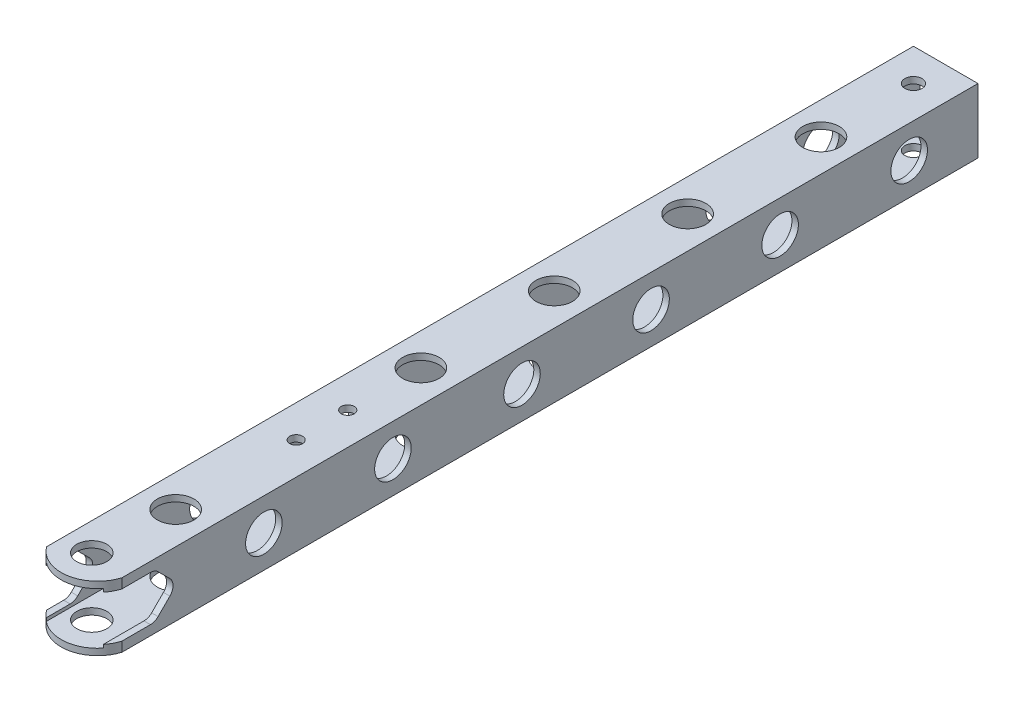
from build123d import *

# Parameters (mm, degrees)
EXTRUSION1_DEPTH           = 395
EXTRUSION1_DEPTH_BACK      = 15
ESQUISSE1_W                = 30
ESQUISSE1_H                = 30
ESQUISSE1_W_2              = 24
ESQUISSE1_H_2              = 24
ESQUISSE2_R                = 8.5
ENL_V_MAT_EXTRU_1_DEPTH    = 397.421492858
R_P_TITION_LIN_AIRE4_COUNT = 4
R_P_TITION_LIN_AIRE4_PITCH = 62
ESQUISSE5_R                = 8.5
ENL_V_MAT_EXTRU_4_DEPTH    = 397.421492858
ENL_V_MAT_EXTRU_3_REACH    = 398.421
ESQUISSE4_R                = 8.5
R_P_TITION_LIN_AIRE5_COUNT = 6
R_P_TITION_LIN_AIRE5_PITCH = 60
ENL_V_MAT_EXTRU_2_REACH    = 398.421
ESQUISSE3_R                = 8.5
ENL_V_MAT_EXTRU_5_REACH    = 398.421
ESQUISSE6_R                = 8.5
R_P_TITION_LIN_AIRE6_COUNT = 5
R_P_TITION_LIN_AIRE6_PITCH = 60
D_GAGEMENT_M61_D           = 6
ESQUISSE9_R                = 7
ENL_V_MAT_EXTRU_6_DEPTH    = 397.421492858
ENL_V_MAT_EXTRU_7_DEPTH    = 397.421492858
ENL_V_MAT_EXTRU_8_DEPTH    = 3
ENL_V_MAT_EXTRU_9_REACH    = 398.421
CONG_1_R                   = 5
ESQUISSE13_R               = 4
ENL_V_MAT_EXTRU_10_DEPTH   = 397.421492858


with BuildPart() as part:
    # Esquisse1 → Extrusion1 (new, two sides: drawn at the far end of the back side and taken through both)
    with BuildSketch(Plane.XY.offset(-EXTRUSION1_DEPTH_BACK)):
        Rectangle(ESQUISSE1_W, ESQUISSE1_H)
        Rectangle(ESQUISSE1_W_2, ESQUISSE1_H_2, mode=Mode.SUBTRACT)
    extrude(amount=EXTRUSION1_DEPTH + EXTRUSION1_DEPTH_BACK)

    # Esquisse2 → Enl_v. mat.-Extru.1 (cut, through all)
    with BuildSketch(Plane(origin=(0, 15, 0), x_dir=(-1, 0, 0), z_dir=(0, 1, 0))):
        with Locations((0, 43)):
            Circle(ESQUISSE2_R)
    enl_v_mat_extru_1 = extrude(amount=-ENL_V_MAT_EXTRU_1_DEPTH, mode=Mode.SUBTRACT)

    # R_p_tition lin_aire4: Enl_v. mat.-Extru.1 ×4
    with Locations(*[(0, 0, i * R_P_TITION_LIN_AIRE4_PITCH) for i in range(1, R_P_TITION_LIN_AIRE4_COUNT)]):
        add(enl_v_mat_extru_1, mode=Mode.SUBTRACT)

    # Esquisse5 → Enl_v. mat.-Extru.4 (cut, through all)
    with BuildSketch(Plane(origin=(0, 15, 0), x_dir=(-1, 0, 0), z_dir=(0, 1, 0))):
        with Locations((0, 343)):
            Circle(ESQUISSE5_R)
    extrude(amount=-ENL_V_MAT_EXTRU_4_DEPTH, mode=Mode.SUBTRACT)

    # Esquisse4 → Enl_v. mat.-Extru.3 (cut, up to next)
    with BuildSketch(Plane(origin=(15, 0, 0), x_dir=(0, 0, -1), z_dir=(1, 0, 0)), mode=Mode.PRIVATE) as enl_v_mat_extru_3_sk1:
        with Locations(Location((-17, 0, 0), (0, 0, 90))):
            Circle(ESQUISSE4_R)
    enl_v_mat_extru_3_tool1 = extrude(enl_v_mat_extru_3_sk1.sketch, amount=-ENL_V_MAT_EXTRU_3_REACH, mode=Mode.PRIVATE) & part.part
    enl_v_mat_extru_3 = enl_v_mat_extru_3_tool1.solids().sort_by_distance((15, 0, 17))[0]
    add(enl_v_mat_extru_3, mode=Mode.SUBTRACT)

    # R_p_tition lin_aire5: Enl_v. mat.-Extru.3 ×6
    with Locations(*[(0, 0, i * R_P_TITION_LIN_AIRE5_PITCH) for i in range(1, R_P_TITION_LIN_AIRE5_COUNT)]):
        add(enl_v_mat_extru_3, mode=Mode.SUBTRACT)

    # Esquisse3 → Enl_v. mat.-Extru.2 (cut, up to next)
    with BuildSketch(Plane.ZY.offset(15), mode=Mode.PRIVATE) as enl_v_mat_extru_2_sk1:
        with Locations(Location((31, 0, 0), (0, 0, 270))):
            Circle(ESQUISSE3_R)
    enl_v_mat_extru_2_tool1 = extrude(enl_v_mat_extru_2_sk1.sketch, amount=-ENL_V_MAT_EXTRU_2_REACH, mode=Mode.PRIVATE) & part.part
    add(enl_v_mat_extru_2_tool1.solids().sort_by_distance((-15, 0, 31))[0], mode=Mode.SUBTRACT)

    # Esquisse6 → Enl_v. mat.-Extru.5 (cut, up to next)
    with BuildSketch(Plane.ZY.offset(15), mode=Mode.PRIVATE) as enl_v_mat_extru_5_sk1:
        with Locations(Location((76, 0, 0), (0, 0, 270))):
            Circle(ESQUISSE6_R)
    enl_v_mat_extru_5_tool1 = extrude(enl_v_mat_extru_5_sk1.sketch, amount=-ENL_V_MAT_EXTRU_5_REACH, mode=Mode.PRIVATE) & part.part
    enl_v_mat_extru_5 = enl_v_mat_extru_5_tool1.solids().sort_by_distance((-15, 0, 76))[0]
    add(enl_v_mat_extru_5, mode=Mode.SUBTRACT)

    # R_p_tition lin_aire6: Enl_v. mat.-Extru.5 ×5
    with Locations(*[(0, 0, i * R_P_TITION_LIN_AIRE6_PITCH) for i in range(1, R_P_TITION_LIN_AIRE6_COUNT)]):
        add(enl_v_mat_extru_5, mode=Mode.SUBTRACT)

    # D_gagement M61 (through all)
    with Locations(Plane(origin=(0, 15, 0), x_dir=(-1, 0, 0), z_dir=(0, 1, 0))):
        with Locations((0, 263), (0, 287)):
            Hole(D_GAGEMENT_M61_D / 2)

    # Esquisse9 → Enl_v. mat.-Extru.6 (cut, through all)
    with BuildSketch(Plane(origin=(0, 15, 0), x_dir=(-1, 0, 0), z_dir=(0, 1, 0))):
        with Locations((2, 380)):
            Circle(ESQUISSE9_R)
    extrude(amount=-ENL_V_MAT_EXTRU_6_DEPTH, mode=Mode.SUBTRACT)

    # Esquisse10 → Enl_v. mat.-Extru.7 (cut, through all)
    with BuildSketch(Plane(origin=(0, 15, 0), x_dir=(-1, 0, 0), z_dir=(0, 1, 0))):
        with BuildLine():
            Line((-15, 383), (-15, 396))
            Line((-15, 396), (15, 396))
            Line((15, 396), (15, 388))
            ThreePointArc((15, 388), (-1.544775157, 394.768650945), (-15, 383))
        make_face()
    extrude(amount=-ENL_V_MAT_EXTRU_7_DEPTH, mode=Mode.SUBTRACT)

    # Esquisse11 → Enl_v. mat.-Extru.8 (cut)
    with BuildSketch(Plane.ZY.offset(15)):
        Polygon((391.171002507, 10.5), (378, 10.5), (367.5, 0), (378, -10.5), (391.171002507, -10.5), align=None)
    extrude(amount=-ENL_V_MAT_EXTRU_8_DEPTH, mode=Mode.SUBTRACT)

    # Esquisse12 → Enl_v. mat.-Extru.9 (cut, up to next)
    with BuildSketch(Plane(origin=(15, 0, 0), x_dir=(0, 0, -1), z_dir=(1, 0, 0)), mode=Mode.PRIVATE) as enl_v_mat_extru_9_sk1:
        Polygon((-388.652011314, -10.5), (-367.652011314, -10.5), (-357.152011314, 0), (-367.652011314, 10.5), (-388.652011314, 10.5), align=None)
    enl_v_mat_extru_9_tool1 = extrude(enl_v_mat_extru_9_sk1.sketch, amount=-ENL_V_MAT_EXTRU_9_REACH, mode=Mode.PRIVATE) & part.part
    add(enl_v_mat_extru_9_tool1.solids().sort_by_distance((15, 0, 375.352011))[0], mode=Mode.SUBTRACT)

    # Cong_1
    cong_1_edges = [part.edges().sort_by_distance(p)[0] for p in [
        (-13.5, 10.5, 378),
        (-13.5, 0, 367.5),
        (-13.5, -10.5, 378),
        (13.5, -10.5, 367.652011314),
        (13.5, 0, 357.152011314),
        (13.5, 10.5, 367.652011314),
    ]]
    fillet(cong_1_edges, radius=CONG_1_R)

    # Esquisse13 → Enl_v. mat.-Extru.10 (cut, through all)
    with BuildSketch(Plane(origin=(0, 15, 0), x_dir=(-1, 0, 0), z_dir=(0, 1, 0))):
        Circle(ESQUISSE13_R)
    extrude(amount=-ENL_V_MAT_EXTRU_10_DEPTH, mode=Mode.SUBTRACT)


solid = part.part
